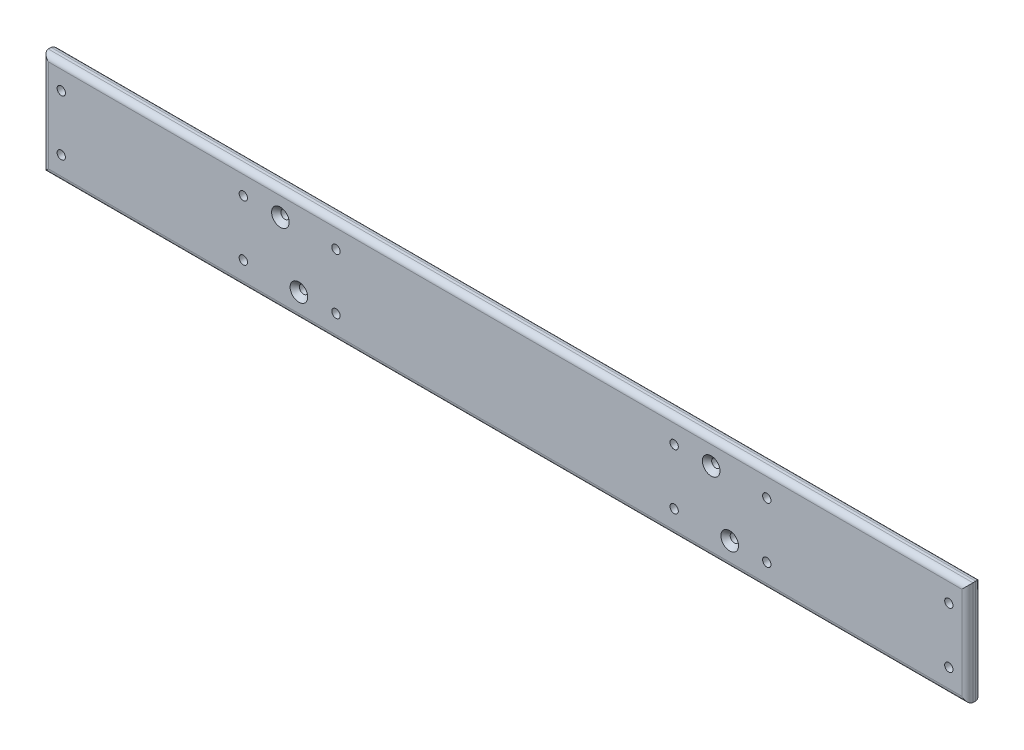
from build123d import *

# Parameters (mm, degrees)
ESQUISSE1_W          = 998
ESQUISSE1_H          = 112
ESQUISSE1_R          = 4.5
BASE_EXTRUSION_DEPTH = 15
CONG_1_R             = 6
CHANFREIN1_SIZE      = 5


with BuildPart() as part:
    # Esquisse1 → Base-Extrusion (new body)
    with BuildSketch(Plane.XY):
        with Locations((1000, 56)):
            Rectangle(ESQUISSE1_W, ESQUISSE1_H)
        with Locations((717.5, 86)):
            Circle(ESQUISSE1_R, mode=Mode.SUBTRACT)
        with Locations((757.5, 86)):
            Circle(ESQUISSE1_R, mode=Mode.SUBTRACT)
        with Locations((777.5, 26)):
            Circle(ESQUISSE1_R, mode=Mode.SUBTRACT)
        with Locations((1222.5, 86)):
            Circle(ESQUISSE1_R, mode=Mode.SUBTRACT)
        with Locations((521, 86)):
            Circle(ESQUISSE1_R, mode=Mode.SUBTRACT)
        with Locations((521, 26)):
            Circle(ESQUISSE1_R, mode=Mode.SUBTRACT)
        with Locations((1479, 86)):
            Circle(ESQUISSE1_R, mode=Mode.SUBTRACT)
        with Locations((1479, 26)):
            Circle(ESQUISSE1_R, mode=Mode.SUBTRACT)
        with Locations((1242.5, 26)):
            Circle(ESQUISSE1_R, mode=Mode.SUBTRACT)
        with Locations((1182.5, 86)):
            Circle(ESQUISSE1_R, mode=Mode.SUBTRACT)
        with Locations((1182.5, 26)):
            Circle(ESQUISSE1_R, mode=Mode.SUBTRACT)
        with Locations((1282.5, 26)):
            Circle(ESQUISSE1_R, mode=Mode.SUBTRACT)
        with Locations((1282.5, 86)):
            Circle(ESQUISSE1_R, mode=Mode.SUBTRACT)
        with Locations((717.5, 26)):
            Circle(ESQUISSE1_R, mode=Mode.SUBTRACT)
        with Locations((817.5, 26)):
            Circle(ESQUISSE1_R, mode=Mode.SUBTRACT)
        with Locations((817.5, 86)):
            Circle(ESQUISSE1_R, mode=Mode.SUBTRACT)
    extrude(amount=BASE_EXTRUSION_DEPTH)

    # Cong_1
    cong_1_edges = [part.edges().sort_by_distance(p)[0] for p in [
        (1000, 112, 0),
        (1000, 112, 15),
        (1499, 56, 0),
        (1499, 56, 15),
        (1000, 0, 0),
        (1000, 0, 15),
        (501, 56, 0),
        (501, 56, 15),
    ]]
    fillet(cong_1_edges, radius=CONG_1_R)

    # Chanfrein1
    chanfrein1_edges = [part.edges().sort_by_distance(p)[0] for p in [
        (753, 86, 15),
        (773, 26, 15),
        (1218, 86, 15),
        (1238, 26, 15),
    ]]
    chamfer(chanfrein1_edges, length=CHANFREIN1_SIZE)


solid = part.part
